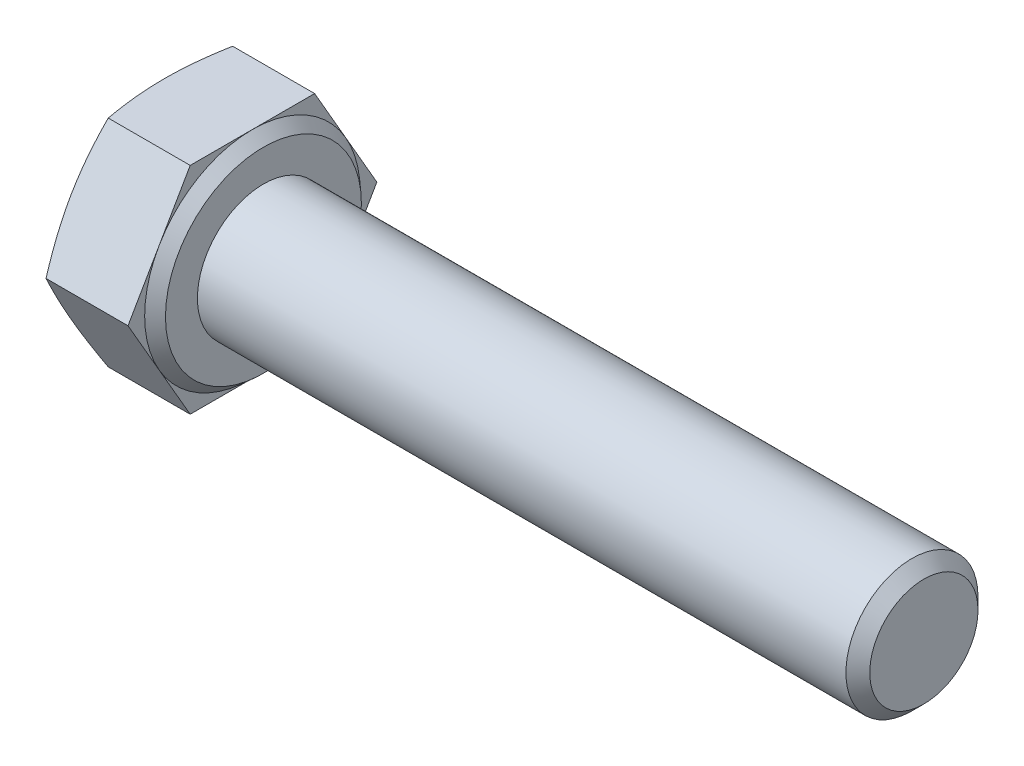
from build123d import *

# Parameters (mm, degrees)
BASEHEAD_DEPTH = 4
SKETCH3_R      = 3
BASEBODY_DEPTH = 30
CHAMFER1_SIZE  = 0.5415


with BuildPart() as part:
    # Sketch-BaseHead → BaseHead (new body)
    with BuildSketch(Plane(origin=(0, 0, 0), x_dir=(0, 0, -1), z_dir=(1, 0, 0))):
        Polygon((5.652259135, 0), (2.826129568, 4.895), (-2.826129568, 4.895), (-5.652259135, 0), (-2.826129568, -4.895), (2.826129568, -4.895), align=None)
    extrude(amount=BASEHEAD_DEPTH)

    # Sketch4 → HeadChamfer (revolve, cut)
    with BuildSketch(Plane(origin=(-0.264637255, 0, 5.916896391), x_dir=(0, 0, -1), z_dir=(0, 1, 0))):
        Polygon((11.569155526, -0.264637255), (10.811896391, -0.264637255), (11.569155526, -0.54025704), align=None)
    revolve(axis=Axis((-4.001564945, 0, 0), (1, 0, 0)), mode=Mode.SUBTRACT)

    # Sketch1 → Revolve1 (revolve)
    with BuildSketch(Plane.XY, mode=Mode.PRIVATE) as revolve1_sk:
        Polygon((4, 0), (4.5, 0), (4.5, -4.45), (4, -4.895), align=None)
    revolve(revolve1_sk.sketch.rotate(Axis((-4.001564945, 0, 0), (1, 0, 0)), 270), axis=Axis((-4.001564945, 0, 0), (1, 0, 0)))

    # Sketch3 → BaseBody (add)
    with BuildSketch(Plane(origin=(4.5, 0, 0), x_dir=(0, 0, -1), z_dir=(1, 0, 0))):
        Circle(SKETCH3_R)
    extrude(amount=BASEBODY_DEPTH)

    # Chamfer1
    chamfer1_edges = [part.edges().sort_by_distance(p)[0] for p in [
        (34.5, 0, 3),
    ]]
    chamfer(chamfer1_edges, length=CHAMFER1_SIZE)


solid = part.part
